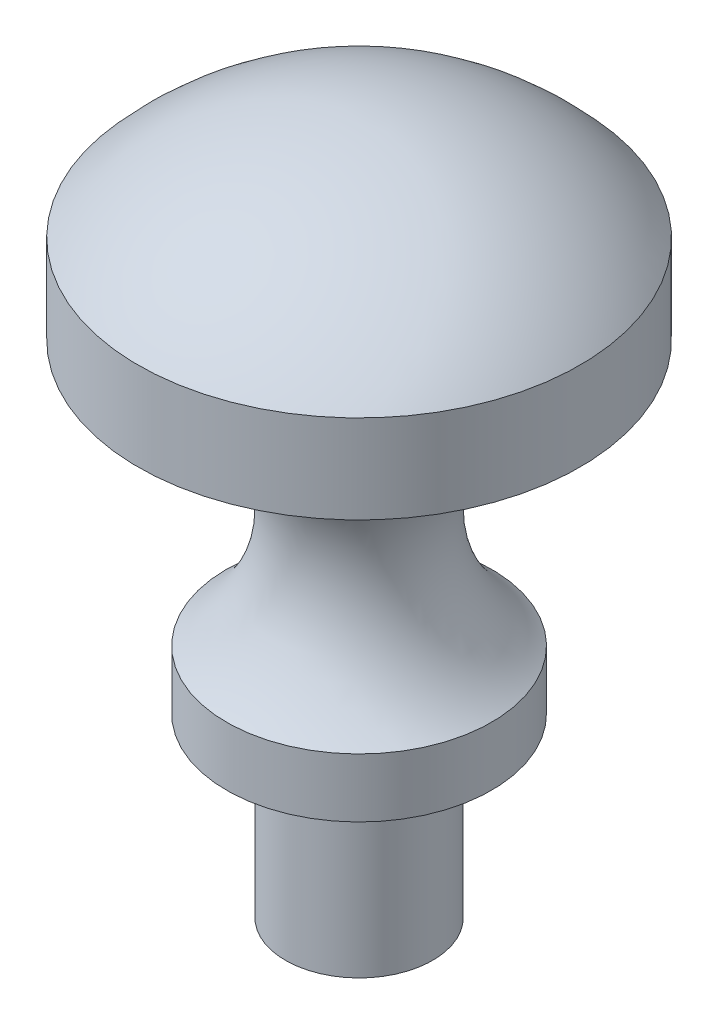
ISO-10303-21;
HEADER;
FILE_DESCRIPTION(('STEP AP214'),'2;1');
FILE_NAME('part.step','',(''),(''),'','','');
FILE_SCHEMA(('AUTOMOTIVE_DESIGN { 1 0 10303 214 1 1 1 1 }'));
ENDSEC;
DATA;
#1=APPLICATION_CONTEXT('core data for automotive mechanical design processes');
#2=APPLICATION_PROTOCOL_DEFINITION('international standard','automotive_design',2000,#1);
#3=PRODUCT_CONTEXT('',#1,'mechanical');
#4=PRODUCT('Part','Part','',(#3));
#5=PRODUCT_RELATED_PRODUCT_CATEGORY('part','',(#4));
#6=PRODUCT_DEFINITION_FORMATION('','',#4);
#7=PRODUCT_DEFINITION_CONTEXT('part definition',#1,'design');
#8=PRODUCT_DEFINITION('design','',#6,#7);
#9=PRODUCT_DEFINITION_SHAPE('','',#8);
#10=(LENGTH_UNIT() NAMED_UNIT(*) SI_UNIT(.MILLI.,.METRE.));
#11=(NAMED_UNIT(*) PLANE_ANGLE_UNIT() SI_UNIT($,.RADIAN.));
#12=(NAMED_UNIT(*) SI_UNIT($,.STERADIAN.) SOLID_ANGLE_UNIT());
#13=UNCERTAINTY_MEASURE_WITH_UNIT(LENGTH_MEASURE(1.E-05),#10,'distance_accuracy_value','');
#14=(GEOMETRIC_REPRESENTATION_CONTEXT(3) GLOBAL_UNCERTAINTY_ASSIGNED_CONTEXT((#13)) GLOBAL_UNIT_ASSIGNED_CONTEXT((#10,
#11,#12)) REPRESENTATION_CONTEXT('',''));
#15=CARTESIAN_POINT('',(0.,0.,0.));
#16=DIRECTION('',(0.,0.,1.));
#17=DIRECTION('',(1.,0.,0.));
#18=AXIS2_PLACEMENT_3D('',#15,#16,#17);
#19=CARTESIAN_POINT('',(0.,143.385621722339,0.));
#20=DIRECTION('',(0.,1.,0.));
#21=DIRECTION('',(-1.,0.,0.));
#22=AXIS2_PLACEMENT_3D('',#19,#20,#21);
#23=SPHERICAL_SURFACE('',#22,10.);
#24=CARTESIAN_POINT('',(0.,150.,0.));
#25=DIRECTION('',(0.,1.,0.));
#26=DIRECTION('',(-1.,0.,0.));
#27=AXIS2_PLACEMENT_3D('',#24,#25,#26);
#28=CIRCLE('',#27,7.5);
#29=CARTESIAN_POINT('',(-7.5,150.,0.));
#30=VERTEX_POINT('',#29);
#31=EDGE_CURVE('E10',#30,#30,#28,.T.);
#32=ORIENTED_EDGE('',*,*,#31,.T.);
#33=EDGE_LOOP('',(#32));
#34=FACE_BOUND('',#33,.T.);
#35=ADVANCED_FACE('F29',(#34),#23,.T.);
#36=CARTESIAN_POINT('',(0.,157.409669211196,0.));
#37=DIRECTION('',(0.,1.,0.));
#38=DIRECTION('',(-1.,0.,0.));
#39=AXIS2_PLACEMENT_3D('',#36,#37,#38);
#40=CYLINDRICAL_SURFACE('',#39,7.5);
#41=CARTESIAN_POINT('',(0.,147.,0.));
#42=DIRECTION('',(0.,1.,0.));
#43=DIRECTION('',(-1.,0.,0.));
#44=AXIS2_PLACEMENT_3D('',#41,#42,#43);
#45=CIRCLE('',#44,7.5);
#46=CARTESIAN_POINT('',(-7.5,147.,0.));
#47=VERTEX_POINT('',#46);
#48=EDGE_CURVE('E35',#47,#47,#45,.T.);
#49=ORIENTED_EDGE('',*,*,#48,.T.);
#50=EDGE_LOOP('',(#49));
#51=FACE_BOUND('',#50,.T.);
#52=ORIENTED_EDGE('',*,*,#31,.F.);
#53=EDGE_LOOP('',(#52));
#54=FACE_BOUND('',#53,.T.);
#55=ADVANCED_FACE('F67',(#51,#54),#40,.T.);
#56=CARTESIAN_POINT('',(0.,142.,0.));
#57=DIRECTION('',(0.,1.,0.));
#58=DIRECTION('',(-1.,0.,0.));
#59=AXIS2_PLACEMENT_3D('',#56,#57,#58);
#60=TOROIDAL_SURFACE('',#59,7.5,5.);
#61=CARTESIAN_POINT('',(0.,138.,0.));
#62=DIRECTION('',(0.,1.,0.));
#63=DIRECTION('',(-1.,0.,0.));
#64=AXIS2_PLACEMENT_3D('',#61,#62,#63);
#65=CIRCLE('',#64,4.5);
#66=CARTESIAN_POINT('',(-4.5,138.,0.));
#67=VERTEX_POINT('',#66);
#68=EDGE_CURVE('E39',#67,#67,#65,.T.);
#69=ORIENTED_EDGE('',*,*,#68,.T.);
#70=EDGE_LOOP('',(#69));
#71=FACE_BOUND('',#70,.T.);
#72=ORIENTED_EDGE('',*,*,#48,.F.);
#73=EDGE_LOOP('',(#72));
#74=FACE_BOUND('',#73,.T.);
#75=ADVANCED_FACE('F71',(#71,#74),#60,.F.);
#76=CARTESIAN_POINT('',(0.,157.409669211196,0.));
#77=DIRECTION('',(0.,1.,0.));
#78=DIRECTION('',(-1.,0.,0.));
#79=AXIS2_PLACEMENT_3D('',#76,#77,#78);
#80=CYLINDRICAL_SURFACE('',#79,4.5);
#81=CARTESIAN_POINT('',(0.,136.,0.));
#82=DIRECTION('',(0.,1.,0.));
#83=DIRECTION('',(-1.,0.,0.));
#84=AXIS2_PLACEMENT_3D('',#81,#82,#83);
#85=CIRCLE('',#84,4.5);
#86=CARTESIAN_POINT('',(-4.5,136.,0.));
#87=VERTEX_POINT('',#86);
#88=EDGE_CURVE('E43',#87,#87,#85,.T.);
#89=ORIENTED_EDGE('',*,*,#88,.T.);
#90=EDGE_LOOP('',(#89));
#91=FACE_BOUND('',#90,.T.);
#92=ORIENTED_EDGE('',*,*,#68,.F.);
#93=EDGE_LOOP('',(#92));
#94=FACE_BOUND('',#93,.T.);
#95=ADVANCED_FACE('F75',(#91,#94),#80,.T.);
#96=CARTESIAN_POINT('',(-2.49999999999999,136.,0.));
#97=DIRECTION('',(0.,-1.,0.));
#98=DIRECTION('',(1.,0.,0.));
#99=AXIS2_PLACEMENT_3D('',#96,#97,#98);
#100=PLANE('',#99);
#101=CARTESIAN_POINT('',(0.,136.,0.));
#102=DIRECTION('',(0.,1.,0.));
#103=DIRECTION('',(-1.,0.,0.));
#104=AXIS2_PLACEMENT_3D('',#101,#102,#103);
#105=CIRCLE('',#104,2.49999999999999);
#106=CARTESIAN_POINT('',(-2.49999999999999,136.,0.));
#107=VERTEX_POINT('',#106);
#108=EDGE_CURVE('E48',#107,#107,#105,.T.);
#109=ORIENTED_EDGE('',*,*,#108,.T.);
#110=EDGE_LOOP('',(#109));
#111=FACE_BOUND('',#110,.T.);
#112=ORIENTED_EDGE('',*,*,#88,.F.);
#113=EDGE_LOOP('',(#112));
#114=FACE_BOUND('',#113,.T.);
#115=ADVANCED_FACE('F64',(#111,#114),#100,.T.);
#116=CARTESIAN_POINT('',(0.,157.409669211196,0.));
#117=DIRECTION('',(0.,1.,0.));
#118=DIRECTION('',(-1.,0.,0.));
#119=AXIS2_PLACEMENT_3D('',#116,#117,#118);
#120=CYLINDRICAL_SURFACE('',#119,2.49999999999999);
#121=CARTESIAN_POINT('',(0.,130.,0.));
#122=DIRECTION('',(0.,1.,0.));
#123=DIRECTION('',(-1.,0.,0.));
#124=AXIS2_PLACEMENT_3D('',#121,#122,#123);
#125=CIRCLE('',#124,2.49999999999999);
#126=CARTESIAN_POINT('',(-2.49999999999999,130.,0.));
#127=VERTEX_POINT('',#126);
#128=EDGE_CURVE('E51',#127,#127,#125,.T.);
#129=ORIENTED_EDGE('',*,*,#128,.T.);
#130=EDGE_LOOP('',(#129));
#131=FACE_BOUND('',#130,.T.);
#132=ORIENTED_EDGE('',*,*,#108,.F.);
#133=EDGE_LOOP('',(#132));
#134=FACE_BOUND('',#133,.T.);
#135=ADVANCED_FACE('F55',(#131,#134),#120,.T.);
#136=CARTESIAN_POINT('',(0.,130.,0.));
#137=DIRECTION('',(0.,-1.,0.));
#138=DIRECTION('',(1.,0.,0.));
#139=AXIS2_PLACEMENT_3D('',#136,#137,#138);
#140=PLANE('',#139);
#141=ORIENTED_EDGE('',*,*,#128,.F.);
#142=EDGE_LOOP('',(#141));
#143=FACE_BOUND('',#142,.T.);
#144=ADVANCED_FACE('F58',(#143),#140,.T.);
#145=CLOSED_SHELL('',(#35,#55,#75,#95,#115,#135,#144));
#146=MANIFOLD_SOLID_BREP('B2',#145);
#147=ADVANCED_BREP_SHAPE_REPRESENTATION('',(#18,#146),#14);
#148=SHAPE_DEFINITION_REPRESENTATION(#9,#147);
ENDSEC;
END-ISO-10303-21;
